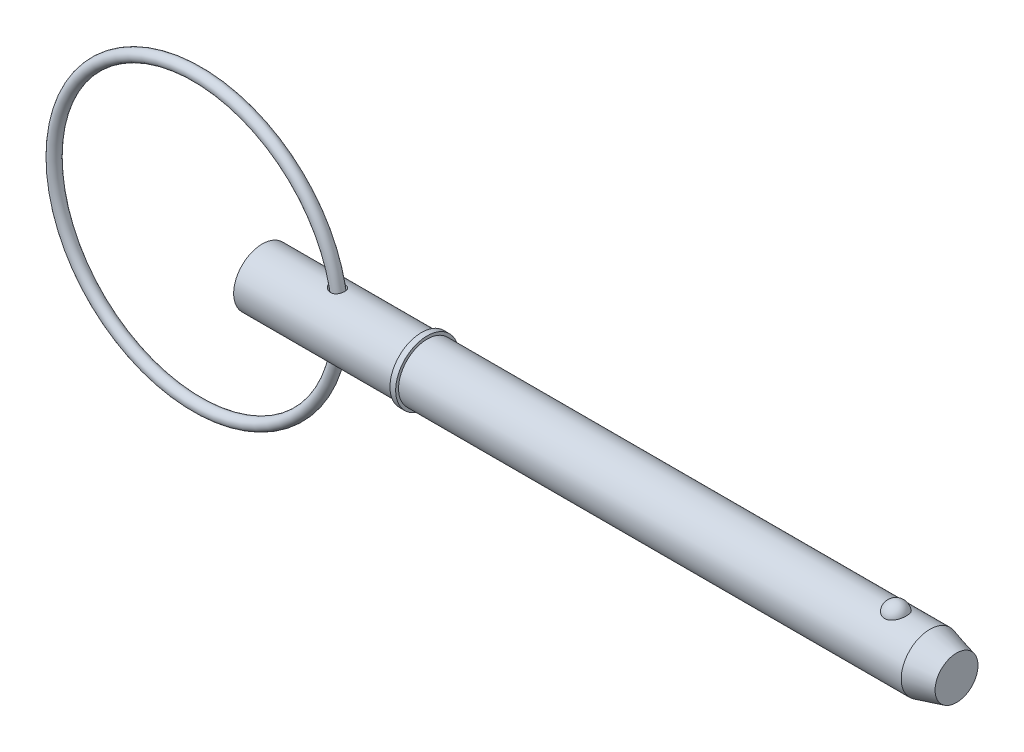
ISO-10303-21;
HEADER;
FILE_DESCRIPTION(('STEP AP214'),'2;1');
FILE_NAME('part.step','',(''),(''),'','','');
FILE_SCHEMA(('AUTOMOTIVE_DESIGN { 1 0 10303 214 1 1 1 1 }'));
ENDSEC;
DATA;
#1=APPLICATION_CONTEXT('core data for automotive mechanical design processes');
#2=APPLICATION_PROTOCOL_DEFINITION('international standard','automotive_design',2000,#1);
#3=PRODUCT_CONTEXT('',#1,'mechanical');
#4=PRODUCT('Part','Part','',(#3));
#5=PRODUCT_RELATED_PRODUCT_CATEGORY('part','',(#4));
#6=PRODUCT_DEFINITION_FORMATION('','',#4);
#7=PRODUCT_DEFINITION_CONTEXT('part definition',#1,'design');
#8=PRODUCT_DEFINITION('design','',#6,#7);
#9=PRODUCT_DEFINITION_SHAPE('','',#8);
#10=(LENGTH_UNIT() NAMED_UNIT(*) SI_UNIT(.MILLI.,.METRE.));
#11=(NAMED_UNIT(*) PLANE_ANGLE_UNIT() SI_UNIT($,.RADIAN.));
#12=(NAMED_UNIT(*) SI_UNIT($,.STERADIAN.) SOLID_ANGLE_UNIT());
#13=UNCERTAINTY_MEASURE_WITH_UNIT(LENGTH_MEASURE(1.E-05),#10,'distance_accuracy_value','');
#14=(GEOMETRIC_REPRESENTATION_CONTEXT(3) GLOBAL_UNCERTAINTY_ASSIGNED_CONTEXT((#13)) GLOBAL_UNIT_ASSIGNED_CONTEXT((#10,
#11,#12)) REPRESENTATION_CONTEXT('',''));
#15=CARTESIAN_POINT('',(0.,0.,0.));
#16=DIRECTION('',(0.,0.,1.));
#17=DIRECTION('',(1.,0.,0.));
#18=AXIS2_PLACEMENT_3D('',#15,#16,#17);
#19=CARTESIAN_POINT('',(-7.21857545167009,0.,0.));
#20=DIRECTION('',(0.,0.,1.));
#21=DIRECTION('',(1.,0.,0.));
#22=AXIS2_PLACEMENT_3D('',#19,#20,#21);
#23=TOROIDAL_SURFACE('',#22,15.875,0.634999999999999);
#24=CARTESIAN_POINT('',(9.29142454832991,0.,0.));
#25=VERTEX_POINT('',#24);
#26=VERTEX_LOOP('',#25);
#27=FACE_BOUND('',#26,.T.);
#28=ADVANCED_FACE('P0_F12',(#27),#23,.T.);
#29=CLOSED_SHELL('',(#28));
#30=MANIFOLD_SOLID_BREP('P0_B1',#29);
#31=CARTESIAN_POINT('',(0.,0.,0.));
#32=DIRECTION('',(1.,0.,0.));
#33=DIRECTION('',(0.,0.,-1.));
#34=AXIS2_PLACEMENT_3D('',#31,#32,#33);
#35=CYLINDRICAL_SURFACE('',#34,3.175);
#36=CARTESIAN_POINT('',(7.68750254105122,3.14043953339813,-0.467187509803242));
#37=CARTESIAN_POINT('',(7.71663570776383,3.13485007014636,-0.504758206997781));
#38=CARTESIAN_POINT('',(7.74907441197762,3.12895198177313,-0.539757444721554));
#39=CARTESIAN_POINT('',(7.81944011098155,3.11722901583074,-0.603799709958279));
#40=CARTESIAN_POINT('',(7.85737550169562,3.11140426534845,-0.632833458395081));
#41=CARTESIAN_POINT('',(7.93756775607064,3.10051072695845,-0.684213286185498));
#42=CARTESIAN_POINT('',(7.97981919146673,3.09544100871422,-0.706567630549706));
#43=CARTESIAN_POINT('',(8.06754397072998,3.08665483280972,-0.744015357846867));
#44=CARTESIAN_POINT('',(8.11301598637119,3.08293782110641,-0.759111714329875));
#45=CARTESIAN_POINT('',(8.20614871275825,3.07732974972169,-0.781538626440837));
#46=CARTESIAN_POINT('',(8.25381727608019,3.07544587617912,-0.788838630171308));
#47=CARTESIAN_POINT('',(8.34973955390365,3.07382984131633,-0.795114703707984));
#48=CARTESIAN_POINT('',(8.39799308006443,3.07409700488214,-0.794093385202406));
#49=CARTESIAN_POINT('',(8.4909727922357,3.07673252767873,-0.783815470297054));
#50=CARTESIAN_POINT('',(8.53575064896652,3.07898913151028,-0.774996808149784));
#51=CARTESIAN_POINT('',(8.62301664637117,3.08521060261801,-0.749844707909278));
#52=CARTESIAN_POINT('',(8.66550527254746,3.08917510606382,-0.733512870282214));
#53=CARTESIAN_POINT('',(8.74528857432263,3.09816330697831,-0.694543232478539));
#54=CARTESIAN_POINT('',(8.78272109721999,3.10313973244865,-0.672175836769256));
#55=CARTESIAN_POINT('',(8.85323831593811,3.11368155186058,-0.621513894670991));
#56=CARTESIAN_POINT('',(8.88632295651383,3.1192469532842,-0.59321927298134));
#57=CARTESIAN_POINT('',(8.94738786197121,3.13037258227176,-0.531394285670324));
#58=CARTESIAN_POINT('',(8.97535151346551,3.13593273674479,-0.497847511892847));
#59=CARTESIAN_POINT('',(9.02535984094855,3.14642822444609,-0.426512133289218));
#60=CARTESIAN_POINT('',(9.04740412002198,3.1513635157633,-0.388723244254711));
#61=CARTESIAN_POINT('',(9.08531615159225,3.16014674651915,-0.309373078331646));
#62=CARTESIAN_POINT('',(9.10109111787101,3.16397813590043,-0.267765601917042));
#63=CARTESIAN_POINT('',(9.12562372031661,3.17004373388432,-0.182419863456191));
#64=CARTESIAN_POINT('',(9.13438129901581,3.17227792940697,-0.138681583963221));
#65=CARTESIAN_POINT('',(9.14467797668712,3.17491257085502,-0.0501907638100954));
#66=CARTESIAN_POINT('',(9.14619790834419,3.17530814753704,-0.00543584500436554));
#67=CARTESIAN_POINT('',(9.14192925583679,3.17420952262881,0.0837005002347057));
#68=CARTESIAN_POINT('',(9.13614065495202,3.17271531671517,0.128081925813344));
#69=CARTESIAN_POINT('',(9.11741184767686,3.16800183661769,0.215146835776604));
#70=CARTESIAN_POINT('',(9.1044818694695,3.1647850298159,0.257832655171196));
#71=CARTESIAN_POINT('',(9.07179341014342,3.15697516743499,0.340371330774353));
#72=CARTESIAN_POINT('',(9.05203467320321,3.15238206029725,0.380224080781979));
#73=CARTESIAN_POINT('',(9.00612949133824,3.14231078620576,0.456042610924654));
#74=CARTESIAN_POINT('',(8.97997137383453,3.13683100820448,0.492001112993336));
#75=CARTESIAN_POINT('',(8.92194141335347,3.12560179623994,0.558920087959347));
#76=CARTESIAN_POINT('',(8.89006980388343,3.11985237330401,0.589880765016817));
#77=CARTESIAN_POINT('',(8.82164045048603,3.10876807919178,0.645751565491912));
#78=CARTESIAN_POINT('',(8.78510991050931,3.1034310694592,0.670694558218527));
#79=CARTESIAN_POINT('',(8.70823767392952,3.09374754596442,0.714035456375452));
#80=CARTESIAN_POINT('',(8.66789657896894,3.08940087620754,0.732434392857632));
#81=CARTESIAN_POINT('',(8.58520620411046,3.08224677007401,0.761976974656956));
#82=CARTESIAN_POINT('',(8.54289637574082,3.07941711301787,0.773225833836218));
#83=CARTESIAN_POINT('',(8.45693772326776,3.07549224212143,0.788693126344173));
#84=CARTESIAN_POINT('',(8.41328889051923,3.07439703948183,0.792911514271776));
#85=CARTESIAN_POINT('',(8.32565716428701,3.07402154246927,0.79436569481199));
#86=CARTESIAN_POINT('',(8.2816736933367,3.07475037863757,0.791566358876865));
#87=CARTESIAN_POINT('',(8.19474198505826,3.0779150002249,0.779168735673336));
#88=CARTESIAN_POINT('',(8.15179398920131,3.0803511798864,0.769568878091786));
#89=CARTESIAN_POINT('',(8.06605600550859,3.08678050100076,0.743371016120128));
#90=CARTESIAN_POINT('',(8.02336243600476,3.09083954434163,0.726473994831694));
#91=CARTESIAN_POINT('',(7.94127890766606,3.10003371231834,0.686178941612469));
#92=CARTESIAN_POINT('',(7.90189016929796,3.10516923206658,0.662778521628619));
#93=CARTESIAN_POINT('',(7.82556689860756,3.11622820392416,0.608722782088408));
#94=CARTESIAN_POINT('',(7.78884764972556,3.12217795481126,0.577767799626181));
#95=CARTESIAN_POINT('',(7.7212485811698,3.13396160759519,0.509990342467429));
#96=CARTESIAN_POINT('',(7.69036894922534,3.13979550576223,0.473167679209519));
#97=CARTESIAN_POINT('',(7.63604128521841,3.15055792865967,0.395137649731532));
#98=CARTESIAN_POINT('',(7.61248286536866,3.15549937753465,0.354009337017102));
#99=CARTESIAN_POINT('',(7.57323986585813,3.16396081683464,0.268021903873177));
#100=CARTESIAN_POINT('',(7.55754910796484,3.16748192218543,0.223165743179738));
#101=CARTESIAN_POINT('',(7.53586686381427,3.17240393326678,0.135111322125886));
#102=CARTESIAN_POINT('',(7.52916366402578,3.17395975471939,0.0920967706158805));
#103=CARTESIAN_POINT('',(7.52342449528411,3.1752897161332,0.00553088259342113));
#104=CARTESIAN_POINT('',(7.52438648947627,3.17506432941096,-0.0380203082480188));
#105=CARTESIAN_POINT('',(7.53361123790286,3.17293298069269,-0.121469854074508));
#106=CARTESIAN_POINT('',(7.54140526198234,3.17113493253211,-0.161424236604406));
#107=CARTESIAN_POINT('',(7.56329403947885,3.16619862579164,-0.239454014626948));
#108=CARTESIAN_POINT('',(7.57738500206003,3.16306117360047,-0.277530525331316));
#109=CARTESIAN_POINT('',(7.60689714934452,3.15670852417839,-0.341419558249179));
#110=CARTESIAN_POINT('',(7.62103486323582,3.15372268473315,-0.367859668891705));
#111=CARTESIAN_POINT('',(7.65218035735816,3.14734507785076,-0.418934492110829));
#112=CARTESIAN_POINT('',(7.66918829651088,3.14395328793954,-0.443569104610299));
#113=CARTESIAN_POINT('',(7.68750254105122,3.14043953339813,-0.467187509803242));
#114=B_SPLINE_CURVE_WITH_KNOTS('',3,(#36,#37,#38,#39,#40,#41,#42,#43,#44,#45,#46,#47,#48,#49,
#50,#51,#52,#53,#54,#55,#56,#57,#58,#59,#60,#61,#62,#63,#64,#65,#66,#67,#68,#69,#70,#71,#72,#73,
#74,#75,#76,#77,#78,#79,#80,#81,#82,#83,#84,#85,#86,#87,#88,#89,#90,#91,#92,#93,#94,#95,#96,#97,
#98,#99,#100,#101,#102,#103,#104,#105,#106,#107,#108,#109,#110,#111,#112,#113),.UNSPECIFIED.,
.T.,.F.,(4,2,2,2,2,2,2,2,2,2,2,2,2,2,2,2,2,2,2,2,2,2,2,2,2,2,2,2,2,2,2,2,2,2,2,2,2,2,4),(0.,
0.143496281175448,0.287214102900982,0.430753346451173,0.574233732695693,0.71827434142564,
0.862269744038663,0.998657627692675,1.13501647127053,1.26606395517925,1.39711310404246,
1.52858014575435,1.66005600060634,1.79341107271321,1.92676723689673,2.06047636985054,
2.19418580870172,2.32770423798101,2.46122766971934,2.59499649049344,2.72875984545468,
2.86177513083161,2.99476944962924,3.12575845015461,3.25674829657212,3.38839514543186,
3.5200724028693,3.65775119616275,3.79548061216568,3.93996868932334,4.08446141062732,
4.22665598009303,4.36873871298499,4.49873145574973,4.62868965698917,4.7503735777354,
4.87198434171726,4.96218670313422,5.05239406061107),.UNSPECIFIED.);
#115=CARTESIAN_POINT('',(7.68750254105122,3.14043953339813,-0.467187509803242));
#116=VERTEX_POINT('',#115);
#117=EDGE_CURVE('P1_E42',#116,#116,#114,.T.);
#118=ORIENTED_EDGE('',*,*,#117,.T.);
#119=EDGE_LOOP('',(#118));
#120=FACE_BOUND('',#119,.T.);
#121=CARTESIAN_POINT('',(0.,0.,0.));
#122=DIRECTION('',(1.,0.,0.));
#123=DIRECTION('',(0.,0.,-1.));
#124=AXIS2_PLACEMENT_3D('',#121,#122,#123);
#125=CIRCLE('',#124,3.175);
#126=CARTESIAN_POINT('',(0.,0.,-3.175));
#127=VERTEX_POINT('',#126);
#128=EDGE_CURVE('P1_E9',#127,#127,#125,.T.);
#129=ORIENTED_EDGE('',*,*,#128,.T.);
#130=EDGE_LOOP('',(#129));
#131=FACE_BOUND('',#130,.T.);
#132=CARTESIAN_POINT('',(17.655,0.,0.));
#133=DIRECTION('',(1.,0.,0.));
#134=DIRECTION('',(0.,0.,-1.));
#135=AXIS2_PLACEMENT_3D('',#132,#133,#134);
#136=CIRCLE('',#135,3.175);
#137=CARTESIAN_POINT('',(17.655,0.,-3.175));
#138=VERTEX_POINT('',#137);
#139=EDGE_CURVE('P1_E25',#138,#138,#136,.T.);
#140=ORIENTED_EDGE('',*,*,#139,.F.);
#141=EDGE_LOOP('',(#140));
#142=FACE_BOUND('',#141,.T.);
#143=CARTESIAN_POINT('',(7.68750254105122,-3.14043953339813,-0.467187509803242));
#144=CARTESIAN_POINT('',(7.66134108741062,-3.14545876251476,-0.433446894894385));
#145=CARTESIAN_POINT('',(7.63782862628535,-3.15023199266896,-0.397612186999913));
#146=CARTESIAN_POINT('',(7.59691922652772,-3.15880505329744,-0.322493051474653));
#147=CARTESIAN_POINT('',(7.57952031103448,-3.16260519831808,-0.283209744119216));
#148=CARTESIAN_POINT('',(7.55152687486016,-3.16882833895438,-0.202021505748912));
#149=CARTESIAN_POINT('',(7.54095517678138,-3.17124671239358,-0.160108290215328));
#150=CARTESIAN_POINT('',(7.52724513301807,-3.1743985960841,-0.0750206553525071));
#151=CARTESIAN_POINT('',(7.52410469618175,-3.17513258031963,-0.031846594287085));
#152=CARTESIAN_POINT('',(7.5253875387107,-3.17483506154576,0.0522260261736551));
#153=CARTESIAN_POINT('',(7.52944265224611,-3.17388949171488,0.0931310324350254));
#154=CARTESIAN_POINT('',(7.54421042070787,-3.17050389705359,0.1736507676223));
#155=CARTESIAN_POINT('',(7.5549232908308,-3.16806382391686,0.213265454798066));
#156=CARTESIAN_POINT('',(7.58252065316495,-3.16195002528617,0.290147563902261));
#157=CARTESIAN_POINT('',(7.59940259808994,-3.15827680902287,0.32741594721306));
#158=CARTESIAN_POINT('',(7.63869293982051,-3.15005936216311,0.398803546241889));
#159=CARTESIAN_POINT('',(7.66110286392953,-3.14551489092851,0.432921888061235));
#160=CARTESIAN_POINT('',(7.71258278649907,-3.13561737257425,0.49975352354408));
#161=CARTESIAN_POINT('',(7.74202268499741,-3.13022938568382,0.532176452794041));
#162=CARTESIAN_POINT('',(7.80559890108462,-3.11946135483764,0.592041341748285));
#163=CARTESIAN_POINT('',(7.83973728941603,-3.11408131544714,0.619481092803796));
#164=CARTESIAN_POINT('',(7.91474520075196,-3.10344314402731,0.670826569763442));
#165=CARTESIAN_POINT('',(7.95593439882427,-3.09822894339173,0.694276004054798));
#166=CARTESIAN_POINT('',(8.04171965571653,-3.08902387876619,0.734150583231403));
#167=CARTESIAN_POINT('',(8.08631621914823,-3.08503319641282,0.750574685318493));
#168=CARTESIAN_POINT('',(8.17840269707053,-3.07873340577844,0.776016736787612));
#169=CARTESIAN_POINT('',(8.22592511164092,-3.07644943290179,0.784924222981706));
#170=CARTESIAN_POINT('',(8.3218479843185,-3.07400734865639,0.79443684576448));
#171=CARTESIAN_POINT('',(8.37024809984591,-3.07384842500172,0.79504515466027));
#172=CARTESIAN_POINT('',(8.46394967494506,-3.07568838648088,0.787894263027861));
#173=CARTESIAN_POINT('',(8.50928504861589,-3.07757975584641,0.78055200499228));
#174=CARTESIAN_POINT('',(8.5979121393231,-3.0831587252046,0.758214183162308));
#175=CARTESIAN_POINT('',(8.6412043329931,-3.08684590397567,0.743220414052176));
#176=CARTESIAN_POINT('',(8.72259527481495,-3.09539071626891,0.706762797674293));
#177=CARTESIAN_POINT('',(8.7608371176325,-3.10019138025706,0.685603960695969));
#178=CARTESIAN_POINT('',(8.83314563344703,-3.11049979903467,0.637201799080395));
#179=CARTESIAN_POINT('',(8.86721230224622,-3.11600755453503,0.609958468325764));
#180=CARTESIAN_POINT('',(8.93027727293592,-3.12712026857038,0.550151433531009));
#181=CARTESIAN_POINT('',(8.95927559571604,-3.13272522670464,0.517587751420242));
#182=CARTESIAN_POINT('',(9.01149093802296,-3.14342495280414,0.448041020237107));
#183=CARTESIAN_POINT('',(9.03470756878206,-3.14851968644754,0.411057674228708));
#184=CARTESIAN_POINT('',(9.07510046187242,-3.15772445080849,0.333109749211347));
#185=CARTESIAN_POINT('',(9.09218248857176,-3.16181883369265,0.292094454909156));
#186=CARTESIAN_POINT('',(9.11940464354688,-3.16848144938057,0.207703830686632));
#187=CARTESIAN_POINT('',(9.12954467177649,-3.17104966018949,0.164328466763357));
#188=CARTESIAN_POINT('',(9.14265964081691,-3.17439058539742,0.0762710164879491));
#189=CARTESIAN_POINT('',(9.14560734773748,-3.17515647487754,0.0315846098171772));
#190=CARTESIAN_POINT('',(9.14418482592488,-3.1747899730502,-0.0576634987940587));
#191=CARTESIAN_POINT('',(9.13981460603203,-3.17365758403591,-0.102225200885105));
#192=CARTESIAN_POINT('',(9.12387791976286,-3.1696201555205,-0.189883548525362));
#193=CARTESIAN_POINT('',(9.11232323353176,-3.16671801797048,-0.232982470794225));
#194=CARTESIAN_POINT('',(9.08231097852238,-3.15945654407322,-0.316576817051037));
#195=CARTESIAN_POINT('',(9.06385315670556,-3.15509715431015,-0.357072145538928));
#196=CARTESIAN_POINT('',(9.02044668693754,-3.14538636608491,-0.434386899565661));
#197=CARTESIAN_POINT('',(8.99548654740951,-3.14003321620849,-0.471199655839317));
#198=CARTESIAN_POINT('',(8.93971208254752,-3.12893289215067,-0.540019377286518));
#199=CARTESIAN_POINT('',(8.9088979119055,-3.12318572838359,-0.572026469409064));
#200=CARTESIAN_POINT('',(8.84235816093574,-3.11197156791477,-0.630185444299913));
#201=CARTESIAN_POINT('',(8.80665432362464,-3.10650347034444,-0.656361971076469));
#202=CARTESIAN_POINT('',(8.73121463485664,-3.09644726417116,-0.702277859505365));
#203=CARTESIAN_POINT('',(8.69147940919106,-3.0918590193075,-0.722018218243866));
#204=CARTESIAN_POINT('',(8.60974645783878,-3.08414607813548,-0.754281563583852));
#205=CARTESIAN_POINT('',(8.56779175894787,-3.08100040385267,-0.766908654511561));
#206=CARTESIAN_POINT('',(8.48229847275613,-3.07640651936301,-0.785135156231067));
#207=CARTESIAN_POINT('',(8.4387599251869,-3.07495826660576,-0.790734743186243));
#208=CARTESIAN_POINT('',(8.35126980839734,-3.07388240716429,-0.794906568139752));
#209=CARTESIAN_POINT('',(8.30731772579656,-3.07425748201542,-0.79346845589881));
#210=CARTESIAN_POINT('',(8.22022709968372,-3.07674606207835,-0.783761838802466));
#211=CARTESIAN_POINT('',(8.17708875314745,-3.07885998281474,-0.775491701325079));
#212=CARTESIAN_POINT('',(8.09089465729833,-3.08468414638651,-0.751997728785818));
#213=CARTESIAN_POINT('',(8.0479194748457,-3.08845808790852,-0.736494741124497));
#214=CARTESIAN_POINT('',(7.96504527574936,-3.09716853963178,-0.698957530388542));
#215=CARTESIAN_POINT('',(7.92514708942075,-3.10210536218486,-0.676921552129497));
#216=CARTESIAN_POINT('',(7.8492503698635,-3.11263013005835,-0.626751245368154));
#217=CARTESIAN_POINT('',(7.81326800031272,-3.11822059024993,-0.598592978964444));
#218=CARTESIAN_POINT('',(7.74635335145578,-3.12944726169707,-0.53681285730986));
#219=CARTESIAN_POINT('',(7.71541970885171,-3.13508346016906,-0.503192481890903));
#220=CARTESIAN_POINT('',(7.68750254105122,-3.14043953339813,-0.467187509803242));
#221=B_SPLINE_CURVE_WITH_KNOTS('',3,(#143,#144,#145,#146,#147,#148,#149,#150,#151,#152,#153,
#154,#155,#156,#157,#158,#159,#160,#161,#162,#163,#164,#165,#166,#167,#168,#169,#170,#171,#172,
#173,#174,#175,#176,#177,#178,#179,#180,#181,#182,#183,#184,#185,#186,#187,#188,#189,#190,#191,
#192,#193,#194,#195,#196,#197,#198,#199,#200,#201,#202,#203,#204,#205,#206,#207,#208,#209,#210,
#211,#212,#213,#214,#215,#216,#217,#218,#219,#220),.UNSPECIFIED.,.T.,.F.,(4,2,2,2,2,2,2,2,2,2,2,
2,2,2,2,2,2,2,2,2,2,2,2,2,2,2,2,2,2,2,2,2,2,2,2,2,2,2,4),(0.,0.128825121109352,
0.257608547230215,0.386820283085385,0.515995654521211,0.638750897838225,0.761510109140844,
0.884218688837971,1.00696120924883,1.13877828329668,1.27065363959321,1.41304496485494,
1.55545741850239,1.69992800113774,1.84434335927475,1.98153642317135,2.11869732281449,
2.24997668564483,2.38125618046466,2.51253513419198,2.64382291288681,2.77704892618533,
2.91027685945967,3.04400848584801,3.17773995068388,3.31125271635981,3.44477037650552,
3.5785256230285,3.71227733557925,3.84545251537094,3.97860705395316,4.10975853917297,
4.24090673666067,4.37224786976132,4.50362039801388,4.64054596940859,4.77750836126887,
4.91501622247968,5.05248689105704),.UNSPECIFIED.);
#222=CARTESIAN_POINT('',(7.68750254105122,-3.14043953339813,-0.467187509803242));
#223=VERTEX_POINT('',#222);
#224=EDGE_CURVE('P1_E17',#223,#223,#221,.T.);
#225=ORIENTED_EDGE('',*,*,#224,.T.);
#226=EDGE_LOOP('',(#225));
#227=FACE_BOUND('',#226,.T.);
#228=ADVANCED_FACE('P1_F13',(#120,#131,#142,#227),#35,.T.);
#229=CARTESIAN_POINT('',(0.,0.,0.));
#230=DIRECTION('',(1.,0.,0.));
#231=DIRECTION('',(0.,0.,-1.));
#232=AXIS2_PLACEMENT_3D('',#229,#230,#231);
#233=CYLINDRICAL_SURFACE('',#232,3.175);
#234=CARTESIAN_POINT('',(74.0476846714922,0.,0.));
#235=DIRECTION('',(1.,0.,0.));
#236=DIRECTION('',(0.,0.,-1.));
#237=AXIS2_PLACEMENT_3D('',#234,#235,#236);
#238=CIRCLE('',#237,3.175);
#239=CARTESIAN_POINT('',(74.0476846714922,0.,-3.175));
#240=VERTEX_POINT('',#239);
#241=EDGE_CURVE('P1_E99',#240,#240,#238,.T.);
#242=ORIENTED_EDGE('',*,*,#241,.F.);
#243=EDGE_LOOP('',(#242));
#244=FACE_BOUND('',#243,.T.);
#245=CARTESIAN_POINT('',(18.29,0.,0.));
#246=DIRECTION('',(1.,0.,0.));
#247=DIRECTION('',(0.,0.,-1.));
#248=AXIS2_PLACEMENT_3D('',#245,#246,#247);
#249=CIRCLE('',#248,3.175);
#250=CARTESIAN_POINT('',(18.29,0.,-3.175));
#251=VERTEX_POINT('',#250);
#252=EDGE_CURVE('P1_E96',#251,#251,#249,.T.);
#253=ORIENTED_EDGE('',*,*,#252,.T.);
#254=EDGE_LOOP('',(#253));
#255=FACE_BOUND('',#254,.T.);
#256=CARTESIAN_POINT('',(70.2757276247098,2.92898950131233,1.2254164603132));
#257=CARTESIAN_POINT('',(70.212316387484,2.92899434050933,1.22541146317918));
#258=CARTESIAN_POINT('',(70.1487979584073,2.93112688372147,1.2203464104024));
#259=CARTESIAN_POINT('',(70.0235306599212,2.93942752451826,1.20020949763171));
#260=CARTESIAN_POINT('',(69.9617869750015,2.9456063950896,1.1851109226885));
#261=CARTESIAN_POINT('',(69.8420651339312,2.96127115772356,1.14540352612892));
#262=CARTESIAN_POINT('',(69.7840775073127,2.97074831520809,1.12081980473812));
#263=CARTESIAN_POINT('',(69.6731943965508,2.99197584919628,1.06285154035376));
#264=CARTESIAN_POINT('',(69.6202966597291,3.0037252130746,1.02947091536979));
#265=CARTESIAN_POINT('',(69.5192688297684,3.02865714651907,0.953674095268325));
#266=CARTESIAN_POINT('',(69.471324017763,3.04187163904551,0.911021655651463));
#267=CARTESIAN_POINT('',(69.3830360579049,3.06808741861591,0.818400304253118));
#268=CARTESIAN_POINT('',(69.3426952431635,3.08108863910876,0.768429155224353));
#269=CARTESIAN_POINT('',(69.2688039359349,3.10614903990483,0.660064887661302));
#270=CARTESIAN_POINT('',(69.2356330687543,3.11814104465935,0.601396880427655));
#271=CARTESIAN_POINT('',(69.1791190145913,3.13926931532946,0.479026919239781));
#272=CARTESIAN_POINT('',(69.1557764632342,3.14840539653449,0.415324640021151));
#273=CARTESIAN_POINT('',(69.1191785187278,3.16298160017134,0.283885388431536));
#274=CARTESIAN_POINT('',(69.1060407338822,3.16837855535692,0.21611080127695));
#275=CARTESIAN_POINT('',(69.0905676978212,3.17475386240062,0.0791367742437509));
#276=CARTESIAN_POINT('',(69.088232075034,3.17573236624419,0.00993738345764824));
#277=CARTESIAN_POINT('',(69.094388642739,3.17318075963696,-0.127420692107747));
#278=CARTESIAN_POINT('',(69.1028073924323,3.16968122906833,-0.195583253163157));
#279=CARTESIAN_POINT('',(69.1301752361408,3.1585790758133,-0.329413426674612));
#280=CARTESIAN_POINT('',(69.1491245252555,3.15097637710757,-0.395080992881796));
#281=CARTESIAN_POINT('',(69.1972057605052,3.13242485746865,-0.522180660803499));
#282=CARTESIAN_POINT('',(69.2263524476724,3.12147119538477,-0.583606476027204));
#283=CARTESIAN_POINT('',(69.2942352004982,3.09734973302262,-0.700436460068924));
#284=CARTESIAN_POINT('',(69.332972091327,3.08418174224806,-0.755840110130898));
#285=CARTESIAN_POINT('',(69.4194771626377,3.05694884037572,-0.859404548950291));
#286=CARTESIAN_POINT('',(69.4672961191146,3.04287919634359,-0.907521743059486));
#287=CARTESIAN_POINT('',(69.5707353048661,3.01548927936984,-0.994758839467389));
#288=CARTESIAN_POINT('',(69.6263549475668,3.0021689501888,-1.03387941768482));
#289=CARTESIAN_POINT('',(69.7428093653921,2.97810316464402,-1.10126594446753));
#290=CARTESIAN_POINT('',(69.8035182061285,2.96731170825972,-1.12973256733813));
#291=CARTESIAN_POINT('',(69.9293712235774,2.94928934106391,-1.17598467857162));
#292=CARTESIAN_POINT('',(69.9945137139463,2.94205708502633,-1.19377420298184));
#293=CARTESIAN_POINT('',(70.1238562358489,2.93233065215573,-1.21746387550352));
#294=CARTESIAN_POINT('',(70.1879385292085,2.92961621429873,-1.22391763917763));
#295=CARTESIAN_POINT('',(70.3163375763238,2.92855752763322,-1.22644976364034));
#296=CARTESIAN_POINT('',(70.3806542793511,2.93021238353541,-1.22253024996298));
#297=CARTESIAN_POINT('',(70.5055239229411,2.9375685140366,-1.20474140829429));
#298=CARTESIAN_POINT('',(70.566131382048,2.94313790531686,-1.19119621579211));
#299=CARTESIAN_POINT('',(70.6841106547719,2.95756226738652,-1.15491492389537));
#300=CARTESIAN_POINT('',(70.7414822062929,2.96641750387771,-1.13217808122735));
#301=CARTESIAN_POINT('',(70.8527699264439,2.98669918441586,-1.07755083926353));
#302=CARTESIAN_POINT('',(70.9065845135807,2.9981771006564,-1.04547308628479));
#303=CARTESIAN_POINT('',(71.0081473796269,3.02240235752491,-0.973220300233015));
#304=CARTESIAN_POINT('',(71.0558942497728,3.03514999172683,-0.933043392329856));
#305=CARTESIAN_POINT('',(71.1465817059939,3.06131230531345,-0.843372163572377));
#306=CARTESIAN_POINT('',(71.1891588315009,3.07472822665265,-0.793510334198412));
#307=CARTESIAN_POINT('',(71.2656765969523,3.10021106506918,-0.687241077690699));
#308=CARTESIAN_POINT('',(71.2996156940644,3.1122777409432,-0.630832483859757));
#309=CARTESIAN_POINT('',(71.3591209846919,3.134208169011,-0.51105938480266));
#310=CARTESIAN_POINT('',(71.3843892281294,3.14399040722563,-0.447531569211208));
#311=CARTESIAN_POINT('',(71.4245117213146,3.15983820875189,-0.31682749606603));
#312=CARTESIAN_POINT('',(71.4393659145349,3.16590375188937,-0.249651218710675));
#313=CARTESIAN_POINT('',(71.458358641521,3.17370076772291,-0.113549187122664));
#314=CARTESIAN_POINT('',(71.4624966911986,3.17543204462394,-0.0446233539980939));
#315=CARTESIAN_POINT('',(71.4599697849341,3.17438372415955,0.0929938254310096));
#316=CARTESIAN_POINT('',(71.4533050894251,3.17160423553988,0.16168517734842));
#317=CARTESIAN_POINT('',(71.4293754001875,3.1618438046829,0.296502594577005));
#318=CARTESIAN_POINT('',(71.4121674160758,3.15488546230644,0.362640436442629));
#319=CARTESIAN_POINT('',(71.367547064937,3.13748892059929,0.490896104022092));
#320=CARTESIAN_POINT('',(71.3401339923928,3.12705048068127,0.553013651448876));
#321=CARTESIAN_POINT('',(71.2754626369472,3.10369139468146,0.67187648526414));
#322=CARTESIAN_POINT('',(71.2381467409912,3.0907563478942,0.728587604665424));
#323=CARTESIAN_POINT('',(71.1545246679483,3.06381731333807,0.83465359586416));
#324=CARTESIAN_POINT('',(71.1082189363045,3.04981337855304,0.884008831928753));
#325=CARTESIAN_POINT('',(71.007718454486,3.02230423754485,0.973916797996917));
#326=CARTESIAN_POINT('',(70.953535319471,3.00879833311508,1.01448227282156));
#327=CARTESIAN_POINT('',(70.8385299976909,2.98383625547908,1.0857155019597));
#328=CARTESIAN_POINT('',(70.7777053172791,2.9723808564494,1.11637952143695));
#329=CARTESIAN_POINT('',(70.6533690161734,2.95329063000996,1.16592590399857));
#330=CARTESIAN_POINT('',(70.5900230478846,2.9455373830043,1.18517901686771));
#331=CARTESIAN_POINT('',(70.4607664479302,2.9342556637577,1.21284802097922));
#332=CARTESIAN_POINT('',(70.3948641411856,2.93071450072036,1.2212964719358));
#333=CARTESIAN_POINT('',(70.311116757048,2.9291525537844,1.22502505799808));
#334=CARTESIAN_POINT('',(70.2934263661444,2.92898815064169,1.22541785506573));
#335=CARTESIAN_POINT('',(70.2757276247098,2.92898950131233,1.2254164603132));
#336=B_SPLINE_CURVE_WITH_KNOTS('',3,(#256,#257,#258,#259,#260,#261,#262,#263,#264,#265,#266,
#267,#268,#269,#270,#271,#272,#273,#274,#275,#276,#277,#278,#279,#280,#281,#282,#283,#284,#285,
#286,#287,#288,#289,#290,#291,#292,#293,#294,#295,#296,#297,#298,#299,#300,#301,#302,#303,#304,
#305,#306,#307,#308,#309,#310,#311,#312,#313,#314,#315,#316,#317,#318,#319,#320,#321,#322,#323,
#324,#325,#326,#327,#328,#329,#330,#331,#332,#333,#334,#335),.UNSPECIFIED.,.T.,.F.,(4,2,2,2,2,2,
2,2,2,2,2,2,2,2,2,2,2,2,2,2,2,2,2,2,2,2,2,2,2,2,2,2,2,2,2,2,2,2,2,4),(0.,0.190186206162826,
0.380880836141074,0.571074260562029,0.761183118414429,0.956866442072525,1.15260970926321,
1.3570177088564,1.56143892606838,1.76818248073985,1.97491892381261,2.18025109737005,
2.38558707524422,2.59122111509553,2.79687285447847,3.00371012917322,3.21053185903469,
3.41323429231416,3.61586005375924,3.80828192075,4.00066436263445,4.18685798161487,
4.37306665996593,4.56330302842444,4.75358348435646,4.95345287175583,5.15335793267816,
5.35957003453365,5.56578325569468,5.7720057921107,5.97822335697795,6.18333558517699,
6.38846199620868,6.59480900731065,6.80114579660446,7.00718137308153,7.21329457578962,
7.41228022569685,7.61066481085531,7.66374777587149),.UNSPECIFIED.);
#337=CARTESIAN_POINT('',(70.2757276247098,2.92898950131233,1.2254164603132));
#338=VERTEX_POINT('',#337);
#339=EDGE_CURVE('P1_E34',#338,#338,#336,.T.);
#340=ORIENTED_EDGE('',*,*,#339,.T.);
#341=EDGE_LOOP('',(#340));
#342=FACE_BOUND('',#341,.T.);
#343=ADVANCED_FACE('P1_F46',(#244,#255,#342),#233,.T.);
#344=CARTESIAN_POINT('',(0.,0.,0.));
#345=DIRECTION('',(-1.,0.,0.));
#346=DIRECTION('',(0.,0.,1.));
#347=AXIS2_PLACEMENT_3D('',#344,#345,#346);
#348=PLANE('',#347);
#349=ORIENTED_EDGE('',*,*,#128,.F.);
#350=EDGE_LOOP('',(#349));
#351=FACE_BOUND('',#350,.T.);
#352=ADVANCED_FACE('P1_F15',(#351),#348,.T.);
#353=CARTESIAN_POINT('',(17.655,3.175,0.));
#354=DIRECTION('',(-1.,0.,0.));
#355=DIRECTION('',(0.,0.,1.));
#356=AXIS2_PLACEMENT_3D('',#353,#354,#355);
#357=PLANE('',#356);
#358=ORIENTED_EDGE('',*,*,#139,.T.);
#359=EDGE_LOOP('',(#358));
#360=FACE_BOUND('',#359,.T.);
#361=CARTESIAN_POINT('',(17.655,0.,0.));
#362=DIRECTION('',(1.,0.,0.));
#363=DIRECTION('',(0.,0.,-1.));
#364=AXIS2_PLACEMENT_3D('',#361,#362,#363);
#365=CIRCLE('',#364,3.4925);
#366=CARTESIAN_POINT('',(17.655,0.,-3.4925));
#367=VERTEX_POINT('',#366);
#368=EDGE_CURVE('P1_E30',#367,#367,#365,.T.);
#369=ORIENTED_EDGE('',*,*,#368,.F.);
#370=EDGE_LOOP('',(#369));
#371=FACE_BOUND('',#370,.T.);
#372=ADVANCED_FACE('P1_F81',(#360,#371),#357,.T.);
#373=CARTESIAN_POINT('',(0.,0.,0.));
#374=DIRECTION('',(1.,0.,0.));
#375=DIRECTION('',(0.,0.,-1.));
#376=AXIS2_PLACEMENT_3D('',#373,#374,#375);
#377=CYLINDRICAL_SURFACE('',#376,3.4925);
#378=ORIENTED_EDGE('',*,*,#368,.T.);
#379=EDGE_LOOP('',(#378));
#380=FACE_BOUND('',#379,.T.);
#381=CARTESIAN_POINT('',(18.29,0.,0.));
#382=DIRECTION('',(1.,0.,0.));
#383=DIRECTION('',(0.,0.,-1.));
#384=AXIS2_PLACEMENT_3D('',#381,#382,#383);
#385=CIRCLE('',#384,3.4925);
#386=CARTESIAN_POINT('',(18.29,0.,-3.4925));
#387=VERTEX_POINT('',#386);
#388=EDGE_CURVE('P1_E95',#387,#387,#385,.T.);
#389=ORIENTED_EDGE('',*,*,#388,.F.);
#390=EDGE_LOOP('',(#389));
#391=FACE_BOUND('',#390,.T.);
#392=ADVANCED_FACE('P1_F68',(#380,#391),#377,.T.);
#393=CARTESIAN_POINT('',(18.29,3.4925,0.));
#394=DIRECTION('',(1.,0.,0.));
#395=DIRECTION('',(0.,0.,-1.));
#396=AXIS2_PLACEMENT_3D('',#393,#394,#395);
#397=PLANE('',#396);
#398=ORIENTED_EDGE('',*,*,#388,.T.);
#399=EDGE_LOOP('',(#398));
#400=FACE_BOUND('',#399,.T.);
#401=ORIENTED_EDGE('',*,*,#252,.F.);
#402=EDGE_LOOP('',(#401));
#403=FACE_BOUND('',#402,.T.);
#404=ADVANCED_FACE('P1_F62',(#400,#403),#397,.T.);
#405=CARTESIAN_POINT('',(77.01,0.,0.));
#406=DIRECTION('',(-1.,0.,0.));
#407=DIRECTION('',(0.,0.,1.));
#408=AXIS2_PLACEMENT_3D('',#405,#406,#407);
#409=CONICAL_SURFACE('',#408,2.38125000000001,0.26179938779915);
#410=ORIENTED_EDGE('',*,*,#241,.T.);
#411=EDGE_LOOP('',(#410));
#412=FACE_BOUND('',#411,.T.);
#413=CARTESIAN_POINT('',(77.01,0.,0.));
#414=DIRECTION('',(1.,0.,0.));
#415=DIRECTION('',(0.,0.,-1.));
#416=AXIS2_PLACEMENT_3D('',#413,#414,#415);
#417=CIRCLE('',#416,2.38125000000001);
#418=CARTESIAN_POINT('',(77.01,0.,-2.38125000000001));
#419=VERTEX_POINT('',#418);
#420=EDGE_CURVE('P1_E41',#419,#419,#417,.T.);
#421=ORIENTED_EDGE('',*,*,#420,.F.);
#422=EDGE_LOOP('',(#421));
#423=FACE_BOUND('',#422,.T.);
#424=ADVANCED_FACE('P1_F59',(#412,#423),#409,.T.);
#425=CARTESIAN_POINT('',(77.01,2.38125000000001,0.));
#426=DIRECTION('',(1.,0.,0.));
#427=DIRECTION('',(0.,0.,-1.));
#428=AXIS2_PLACEMENT_3D('',#425,#426,#427);
#429=PLANE('',#428);
#430=ORIENTED_EDGE('',*,*,#420,.T.);
#431=EDGE_LOOP('',(#430));
#432=FACE_BOUND('',#431,.T.);
#433=ADVANCED_FACE('P1_F55',(#432),#429,.T.);
#434=CARTESIAN_POINT('',(70.2757276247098,2.8575,0.));
#435=DIRECTION('',(-1.,0.,0.));
#436=DIRECTION('',(0.,1.,0.));
#437=AXIS2_PLACEMENT_3D('',#434,#435,#436);
#438=SPHERICAL_SURFACE('',#437,1.22750000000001);
#439=ORIENTED_EDGE('',*,*,#339,.F.);
#440=EDGE_LOOP('',(#439));
#441=FACE_BOUND('',#440,.T.);
#442=ADVANCED_FACE('P1_F50',(#441),#438,.T.);
#443=CARTESIAN_POINT('',(-7.21857545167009,0.,0.));
#444=DIRECTION('',(0.,0.,1.));
#445=DIRECTION('',(1.,0.,0.));
#446=AXIS2_PLACEMENT_3D('',#443,#444,#445);
#447=TOROIDAL_SURFACE('',#446,15.875,0.793749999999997);
#448=ORIENTED_EDGE('',*,*,#224,.F.);
#449=EDGE_LOOP('',(#448));
#450=FACE_BOUND('',#449,.T.);
#451=ORIENTED_EDGE('',*,*,#117,.F.);
#452=EDGE_LOOP('',(#451));
#453=FACE_BOUND('',#452,.T.);
#454=ADVANCED_FACE('P1_F54',(#450,#453),#447,.F.);
#455=CLOSED_SHELL('',(#228,#343,#352,#372,#392,#404,#424,#433,#442,#454));
#456=MANIFOLD_SOLID_BREP('P1_B1',#455);
#457=ADVANCED_BREP_SHAPE_REPRESENTATION('',(#18,#30,#456),#14);
#458=SHAPE_DEFINITION_REPRESENTATION(#9,#457);
ENDSEC;
END-ISO-10303-21;
